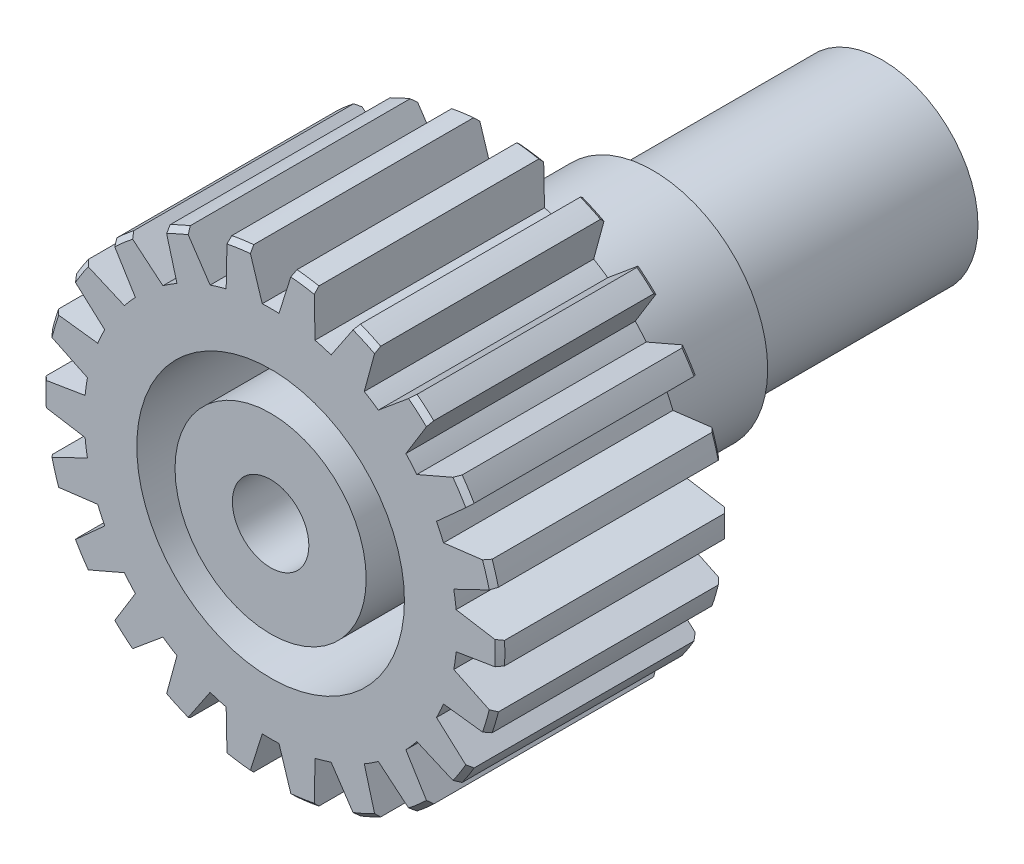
from build123d import *

# Parameters (mm, degrees)
ESQUISSE2_R                     = 6
DIAM_TRE_DE_T_TE_DEPTH          = 3
CHANFREINS_SIZE                 = 0.125
CREUX_DENT_DEPTH                = 10
CREUX_DENT_DEPTH_BACK           = 10
R_P_TITION_COUNT                = 22
ESQUISSE4_R                     = 1
ENL_V_MAT_EXTRU_1_DEPTH         = 11.376847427
ESQUISSE5_R                     = 3
EXTRUSION1_DEPTH                = 4
ESQUISSE6_R                     = 2.5
EXTRUSION2_DEPTH                = 6
ENL_V_MAT_EXTRU_2_DEPTH         = 8
ESQUISSE8_R                     = 3.5
ESQUISSE8_R_2                   = 2.5
ENL_V_DE_MAT_EXTRU_MINCE1_DEPTH = 5


with BuildPart() as part:
    # Esquisse2 → Diam_tre de t_te (new, symmetric)
    with BuildSketch(Plane.XY):
        Circle(ESQUISSE2_R)
    extrude(amount=DIAM_TRE_DE_T_TE_DEPTH, both=True)

    # Chanfreins
    chanfreins_edges = [part.edges().sort_by_distance(p)[0] for p in [
        (-6, 0, -3),
        (-6, 0, 3),
    ]]
    chamfer(chanfreins_edges, length=CHANFREINS_SIZE)

    # Esquisse3 → Creux dent (cut, two sides: drawn at the far end of the back side and taken through both)
    with BuildSketch(Plane.XY.offset(-CREUX_DENT_DEPTH_BACK)):
        with BuildLine():
            Line((-0.218795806, 4.870087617), (-0.566601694, 5.973186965))
            ThreePointArc((-0.566601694, 5.973186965), (0, 6), (0.566601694, 5.973186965))
            Line((0.566601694, 5.973186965), (0.218795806, 4.870087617))
            ThreePointArc((0.218795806, 4.870087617), (0, 4.875), (-0.218795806, 4.870087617))
        make_face()
    creux_dent = extrude(amount=CREUX_DENT_DEPTH + CREUX_DENT_DEPTH_BACK, mode=Mode.SUBTRACT)

    # R_p_tition: Creux dent ×22 about axis
    r_p_tition_axis = Axis((0, 0, 0), (0, 0, 1))
    for i in range(1, R_P_TITION_COUNT):
        add(creux_dent.rotate(r_p_tition_axis, i * 360 / R_P_TITION_COUNT), mode=Mode.SUBTRACT)

    # Esquisse4 → Enl_v. mat.-Extru.1 (cut, through all)
    with BuildSketch(Plane.XY.offset(3)):
        Circle(ESQUISSE4_R)
    extrude(amount=-ENL_V_MAT_EXTRU_1_DEPTH, mode=Mode.SUBTRACT)

    # Esquisse5 → Extrusion1 (add)
    with BuildSketch(Plane(origin=(0, 0, -3), x_dir=(-1, 0, 0), z_dir=(0, 0, -1))):
        with Locations(Location((0, 0, 0), (0, 0, 180))):
            Circle(ESQUISSE5_R)
    extrude(amount=EXTRUSION1_DEPTH)

    # Esquisse6 → Extrusion2 (add)
    with BuildSketch(Plane(origin=(0, 0, -7), x_dir=(-1, 0, 0), z_dir=(0, 0, -1))):
        Circle(ESQUISSE6_R)
    extrude(amount=EXTRUSION2_DEPTH)

    # Esquisse7 → Enl_v. mat.-Extru.2 (cut)
    with BuildSketch(Plane(origin=(0, 0, -13), x_dir=(-1, 0, 0), z_dir=(0, 0, -1))):
        Polygon((1.732050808, 0), (0.866025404, 1.5), (-0.866025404, 1.5), (-1.732050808, 0), (-0.866025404, -1.5), (0.866025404, -1.5), align=None)
    extrude(amount=-ENL_V_MAT_EXTRU_2_DEPTH, mode=Mode.SUBTRACT)

    # Esquisse8 → Enl_v. de mat.-Extru.-Mince1 (cut)
    with BuildSketch(Plane.XY.offset(3)):
        Circle(ESQUISSE8_R)
        Circle(ESQUISSE8_R_2, mode=Mode.SUBTRACT)
    extrude(amount=-ENL_V_DE_MAT_EXTRU_MINCE1_DEPTH, mode=Mode.SUBTRACT)


solid = part.part
